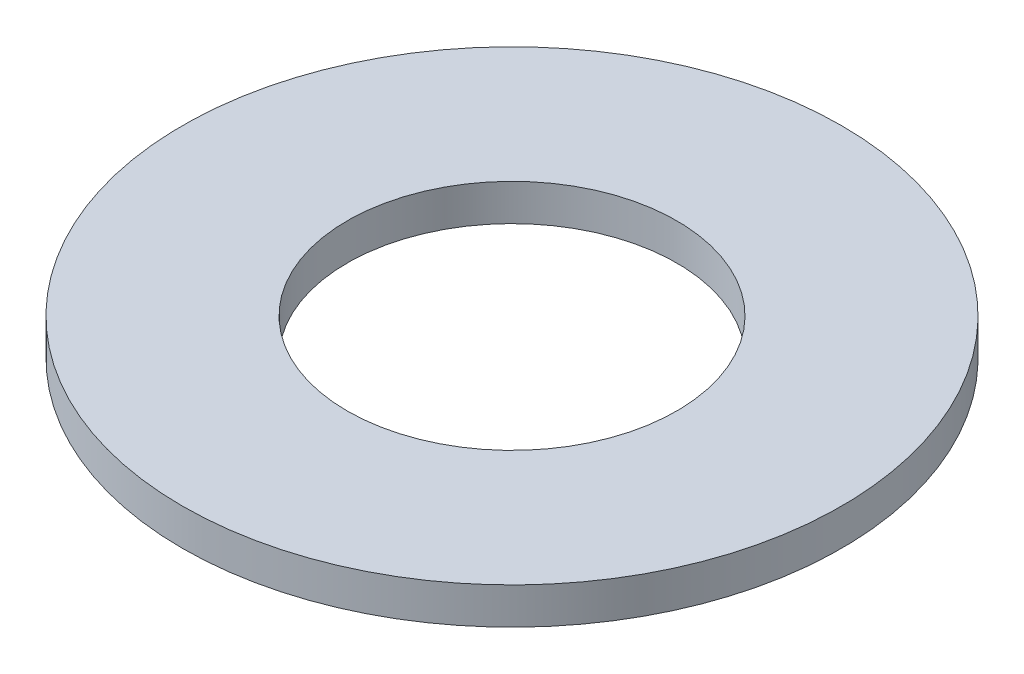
from build123d import *

# Parameters (mm, degrees)
SKETCH1_R          = 4.5
BASE_EXTRUDE_DEPTH = 0.5
SKETCH2_R          = 2.25
CUT_EXTRUDE1_DEPTH = 7.383572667


with BuildPart() as part:
    # Sketch1 → Base-Extrude (new body)
    with BuildSketch(Plane(origin=(0, 0, 0), x_dir=(1, 0, 0), z_dir=(0, 1, 0))):
        with Locations(Location((0, 0, 0), (0, 0, 270))):
            Circle(SKETCH1_R)
    extrude(amount=BASE_EXTRUDE_DEPTH)

    # Sketch2 → Cut-Extrude1 (cut, through all)
    with BuildSketch(Plane(origin=(0, 0.5, 0), x_dir=(-1, 0, 0), z_dir=(0, 1, 0))):
        with Locations(Location((0, 0, 0), (0, 0, 90))):
            Circle(SKETCH2_R)
    extrude(amount=-CUT_EXTRUDE1_DEPTH, mode=Mode.SUBTRACT)


solid = part.part
